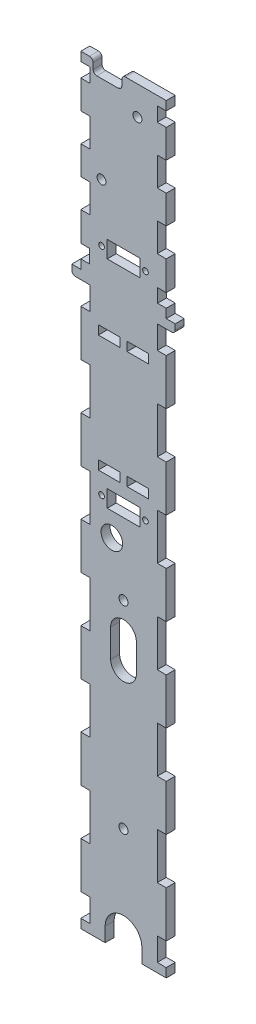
from build123d import *

# Parameters (mm, degrees)
SKETCH1_W                    = 30.17980714
SKETCH1_H                    = 268.2875
BOSS_EXTRUDE1_DEPTH          = 3.175
SKETCH3_W                    = 3.175
SKETCH3_H                    = 3.175
BOSS_EXTRUDE3_DEPTH          = 3.175
SKETCH4_W                    = 6.35
SKETCH4_H                    = 8.1359375
CUT_EXTRUDE1_DEPTH           = 271.371608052
SKETCH5_W                    = 6.35
SKETCH5_H                    = 16.271875
CUT_EXTRUDE2_DEPTH           = 271.371608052
LPATTERN1_COUNT              = 5
LPATTERN1_PITCH              = 32.54375
SKETCH6_W                    = 6.35
SKETCH6_H                    = 8.1359375
CUT_EXTRUDE3_DEPTH           = 271.371608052
SKETCH7_W                    = 6.152700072
SKETCH7_H                    = 4.7625
CUT_EXTRUDE4_DEPTH           = 271.371608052
SKETCH8_W                    = 6.35
SKETCH8_H                    = 10.054166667
CUT_EXTRUDE5_DEPTH           = 271.371608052
LPATTERN3_COUNT              = 2
LPATTERN3_PITCH              = 20.108333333
SKETCH9_W                    = 6.35
SKETCH9_H                    = 5.027083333
CUT_EXTRUDE6_DEPTH           = 271.371608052
F_1_8_0_125_DIAMETER_HOLE1_D = 3.175
CUT_EXTRUDE10_DEPTH          = 271.371608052
SKETCH21_W                   = 7.62
SKETCH21_H                   = 3.175
CUT_EXTRUDE11_DEPTH          = 271.371608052
M3_CLEARANCE_HOLE1_D         = 3.2
CUT_EXTRUDE12_DEPTH          = 271.371608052
SKETCH25_R                   = 3.81
CUT_EXTRUDE13_DEPTH          = 271.371608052
SKETCH27_W                   = 10.16
SKETCH27_H                   = 4.700356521
CUT_EXTRUDE14_DEPTH          = 271.371608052
FILLET1_R                    = 1.27
FILLET2_R                    = 1.27
FILLET3_R                    = 1.27
SKETCH28_R                   = 1.0033
SKETCH28_W                   = 11.5062
SKETCH28_H                   = 5.9944
CUT_EXTRUDE15_DEPTH          = 271.371608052


with BuildPart() as part:
    # Sketch1 → Boss-Extrude1 (new body)
    with BuildSketch(Plane.XY):
        with Locations((15.08990357, 134.14375)):
            Rectangle(SKETCH1_W, SKETCH1_H)
    extrude(amount=BOSS_EXTRUDE1_DEPTH)

    # Sketch3 → Boss-Extrude3 (add)
    with BuildSketch(Plane.ZY):
        with Locations((1.5875, 200.025)):
            Rectangle(SKETCH3_W, SKETCH3_H)
    boss_extrude3 = extrude(amount=BOSS_EXTRUDE3_DEPTH)

    # Mirror1: Boss-Extrude3 across plane
    add(boss_extrude3.mirror(Plane.ZY.offset(-15.08990357)))

    # Sketch4 → Cut-Extrude1 (cut, through all)
    with BuildSketch(Plane.XY.offset(3.175)):
        with Locations((0, 7.24296875)):
            Rectangle(SKETCH4_W, SKETCH4_H)
        with Locations((30.17980714, 7.24296875)):
            Rectangle(SKETCH4_W, SKETCH4_H)
    extrude(amount=-CUT_EXTRUDE1_DEPTH, mode=Mode.SUBTRACT)

    # Sketch5 → Cut-Extrude2 (cut, through all)
    with BuildSketch(Plane.XY.offset(3.175)):
        with Locations((0, 35.71875)):
            Rectangle(SKETCH5_W, SKETCH5_H)
        with Locations((30.17980714, 35.71875)):
            Rectangle(SKETCH5_W, SKETCH5_H)
    cut_extrude2 = extrude(amount=-CUT_EXTRUDE2_DEPTH, mode=Mode.SUBTRACT)

    # LPattern1: Cut-Extrude2 ×5
    with Locations(*[(0, i * LPATTERN1_PITCH, 0) for i in range(1, LPATTERN1_COUNT)]):
        add(cut_extrude2, mode=Mode.SUBTRACT)

    # Sketch6 → Cut-Extrude3 (cut, through all)
    with BuildSketch(Plane.XY.offset(3.175)):
        with Locations((0, 194.36953125)):
            Rectangle(SKETCH6_W, SKETCH6_H)
        with Locations((30.17980714, 194.36953125)):
            Rectangle(SKETCH6_W, SKETCH6_H)
    extrude(amount=-CUT_EXTRUDE3_DEPTH, mode=Mode.SUBTRACT)

    # Sketch7 → Cut-Extrude4 (cut, through all)
    with BuildSketch(Plane.XY.offset(3.175)):
        with Locations((0, 207.16875)):
            Rectangle(SKETCH7_W, SKETCH7_H)
        with Locations((30.17980714, 207.16875)):
            Rectangle(SKETCH7_W, SKETCH7_H)
    extrude(amount=-CUT_EXTRUDE4_DEPTH, mode=Mode.SUBTRACT)

    # Sketch8 → Cut-Extrude5 (cut, through all)
    with BuildSketch(Plane.XY.offset(3.175)):
        with Locations((0, 224.895833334)):
            Rectangle(SKETCH8_W, SKETCH8_H)
        with Locations((30.17980714, 224.895833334)):
            Rectangle(SKETCH8_W, SKETCH8_H)
    cut_extrude5 = extrude(amount=-CUT_EXTRUDE5_DEPTH, mode=Mode.SUBTRACT)

    # LPattern3: Cut-Extrude5 ×2
    with Locations(*[(0, i * LPATTERN3_PITCH, 0) for i in range(1, LPATTERN3_COUNT)]):
        add(cut_extrude5, mode=Mode.SUBTRACT)

    # Sketch9 → Cut-Extrude6 (cut, through all)
    with BuildSketch(Plane.XY.offset(3.175)):
        with Locations((0, 262.598958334)):
            Rectangle(SKETCH9_W, SKETCH9_H)
        with Locations((30.17980714, 262.598958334)):
            Rectangle(SKETCH9_W, SKETCH9_H)
    extrude(amount=-CUT_EXTRUDE6_DEPTH, mode=Mode.SUBTRACT)

    # 1_8 _0.125_ Diameter Hole1 (through all)
    with Locations(Plane.XY.offset(3.175)):
        with Locations((20.01980714, 258.1275), (7.31980714, 232.7275)):
            Hole(F_1_8_0_125_DIAMETER_HOLE1_D / 2)

    # Sketch17 → Cut-Extrude10 (cut, through all)
    with BuildSketch(Plane.XY.offset(3.175)):
        with BuildLine():
            Line((8.61290357, 5.08), (8.61290357, 0))
            Line((8.61290357, 0), (21.56690357, 0))
            Line((21.56690357, 0), (21.56690357, 5.08))
            ThreePointArc((21.56690357, 5.08), (15.08990357, 11.556999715), (8.61290357, 5.08))
        make_face()
    extrude(amount=-CUT_EXTRUDE10_DEPTH, mode=Mode.SUBTRACT)

    # Sketch21 → Cut-Extrude11 (cut, through all)
    with BuildSketch(Plane.XY.offset(3.175)):
        with Locations((10.00990357, 186.193087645)):
            Rectangle(SKETCH21_W, SKETCH21_H)
        with Locations((20.16990357, 186.193087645)):
            Rectangle(SKETCH21_W, SKETCH21_H)
        with Locations((10.00990357, 144.918087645)):
            Rectangle(SKETCH21_W, SKETCH21_H)
        with Locations((20.16990357, 144.918087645)):
            Rectangle(SKETCH21_W, SKETCH21_H)
    extrude(amount=-CUT_EXTRUDE11_DEPTH, mode=Mode.SUBTRACT)

    # M3 Clearance Hole1 (through all)
    with Locations(Plane.XY.offset(3.175)):
        with Locations((15.08990357, 38.1), (15.08990357, 107.95)):
            Hole(M3_CLEARANCE_HOLE1_D / 2)

    # Sketch24 → Cut-Extrude12 (cut, through all)
    with BuildSketch(Plane.XY.offset(3.175)):
        with BuildLine():
            Line((19.628566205, 97.536), (19.628566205, 87.63))
            ThreePointArc((19.628566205, 87.63), (15.08990357, 83.091337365), (10.551240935, 87.63))
            Line((10.551240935, 87.63), (10.551240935, 97.536))
            ThreePointArc((10.551240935, 97.536), (15.08990357, 102.074662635), (19.628566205, 97.536))
        make_face()
    extrude(amount=-CUT_EXTRUDE12_DEPTH, mode=Mode.SUBTRACT)

    # Sketch25 → Cut-Extrude13 (cut, through all)
    with BuildSketch(Plane.XY.offset(3.175)):
        with Locations((10.962908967, 124.989390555)):
            Circle(SKETCH25_R)
    extrude(amount=-CUT_EXTRUDE13_DEPTH, mode=Mode.SUBTRACT)

    # Sketch27 → Cut-Extrude14 (cut, through all)
    with BuildSketch(Plane.XY.offset(3.175)):
        with Locations((9.439171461, 265.93732174)):
            Rectangle(SKETCH27_W, SKETCH27_H)
    extrude(amount=-CUT_EXTRUDE14_DEPTH, mode=Mode.SUBTRACT)

    # Fillet1
    fillet1_edges = [part.edges().sort_by_distance(p)[0] for p in [
        (4.359171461, 268.2875, 1.5875),
        (14.519171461, 268.2875, 1.5875),
    ]]
    fillet(fillet1_edges, radius=FILLET1_R)

    # Fillet2
    fillet2_edges = [part.edges().sort_by_distance(p)[0] for p in [
        (14.519171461, 263.587143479, 1.5875),
        (4.359171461, 263.587143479, 1.5875),
    ]]
    fillet(fillet2_edges, radius=FILLET2_R)

    # Fillet3
    fillet3_edges = [part.edges().sort_by_distance(p)[0] for p in [
        (-3.175, 198.4375, 1.5875),
        (33.35480714, 198.4375, 1.5875),
    ]]
    fillet(fillet3_edges, radius=FILLET3_R)

    # Sketch28 → Cut-Extrude15 (cut, through all)
    with BuildSketch(Plane.XY.offset(3.175)):
        with Locations((7.34290357, 136.212943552)):
            Circle(SKETCH28_R)
        with Locations((22.83690357, 136.212943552)):
            Circle(SKETCH28_R)
        with Locations((7.34290357, 212.445340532)):
            Circle(SKETCH28_R)
        with Locations((22.83690357, 212.445340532)):
            Circle(SKETCH28_R)
        with Locations((15.08990357, 136.212943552)):
            Rectangle(SKETCH28_W, SKETCH28_H)
        with Locations((15.08990357, 212.445340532)):
            Rectangle(SKETCH28_W, SKETCH28_H)
    extrude(amount=-CUT_EXTRUDE15_DEPTH, mode=Mode.SUBTRACT)


solid = part.part
